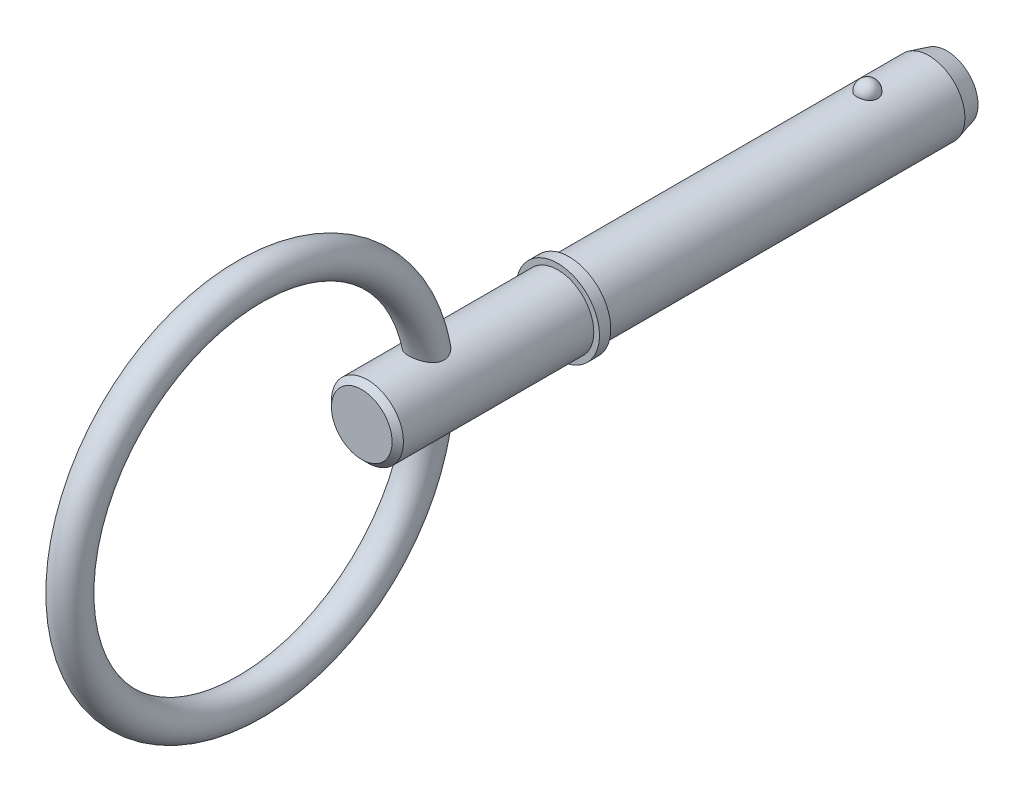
from build123d import *

# Parameters (mm, degrees)
SKETCH2_R           = 3.175
BOSS_EXTRUDE1_DEPTH = 25.4
BOSS_EXTRUDE2_START = 7.92
SKETCH3_R           = 3.175
BOSS_EXTRUDE2_DEPTH = 7.92
CHAMFER1_SIZE       = 1.586
CHAMFER1_SIZE2      = 0.424967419
SKETCH20_W          = 1
SKETCH20_H          = 3.675
SKETCH21_R          = 3.175
BOSS_EXTRUDE3_DEPTH = 18.29
CHAMFER2_SIZE       = 0.5
SKETCH24_R          = 1.5


with BuildPart() as part:
    # Sketch2 → Boss-Extrude1 (new body)
    with BuildSketch(Plane.XY):
        Circle(SKETCH2_R)
    extrude(amount=BOSS_EXTRUDE1_DEPTH)

    # Sketch3 → Boss-Extrude2 (add)
    with BuildSketch(Plane(origin=(0, 0, 0), x_dir=(-1, 0, 0), z_dir=(0, 0, -1)).offset(BOSS_EXTRUDE2_START)):
        Circle(SKETCH3_R)
    extrude(amount=-BOSS_EXTRUDE2_DEPTH)

    # Chamfer1
    chamfer1_edges = [part.edges().sort_by_distance(p)[0] for p in [
        (3.175, 0, -7.92),
    ]]
    chamfer1_side = [part.faces().sort_by_distance(p)[0] for p in [
        (3.175, 0, -3.96),
    ]]
    chamfer(chamfer1_edges, length=CHAMFER1_SIZE, length2=CHAMFER1_SIZE2, reference=chamfer1_side[0])

    # Sketch18 → Revolve1 (revolve)
    with BuildSketch(Plane(origin=(0, 0, 0), x_dir=(0, 0, -1), z_dir=(1, 0, 0))):
        with BuildLine():
            Line((0.91, 4.085), (0.91, 2.265))
            ThreePointArc((0.91, 2.265), (0, 3.175), (0.91, 4.085))
        make_face()
    revolve(axis=Axis((0, 4.085, -0.91), (0, -1, 0)))

    # Sketch20 → Revolve2 (revolve)
    with BuildSketch(Plane(origin=(0, 0, 0), x_dir=(0, 0, -1), z_dir=(1, 0, 0)), mode=Mode.PRIVATE) as revolve2_sk:
        with Locations((-25.9, 1.8375)):
            Rectangle(SKETCH20_W, SKETCH20_H)
    revolve(revolve2_sk.sketch.rotate(Axis((0, 0, 33.728787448), (0, 0, 1)), 90), axis=Axis((0, 0, 33.728787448), (0, 0, 1)))

    # Sketch21 → Boss-Extrude3 (add)
    with BuildSketch(Plane(origin=(0, 0, 25.4), x_dir=(-1, 0, 0), z_dir=(0, 0, -1))):
        Circle(SKETCH21_R)
    extrude(amount=-BOSS_EXTRUDE3_DEPTH)

    # Chamfer2
    chamfer2_edges = [part.edges().sort_by_distance(p)[0] for p in [
        (3.175, 0, 43.69),
    ]]
    chamfer(chamfer2_edges, length=CHAMFER2_SIZE)

    # Sweep1: sweep along a path in Sketch23
    with BuildLine(Plane(origin=(0, 0, 0), x_dir=(0, 0, -1), z_dir=(1, 0, 0))) as sweep1_path:
        CenterArc((-53.565, 0), 15.875, 0, 360)
    # Sketch24 → Sweep1 (sweep)
    with BuildSketch(Plane(origin=(0, 0, 0), x_dir=(1, 0, 0), z_dir=(0, 1, 0))):
        with Locations((0, -37.69)):
            Circle(SKETCH24_R)
    sweep(path=sweep1_path.line)


solid = part.part
